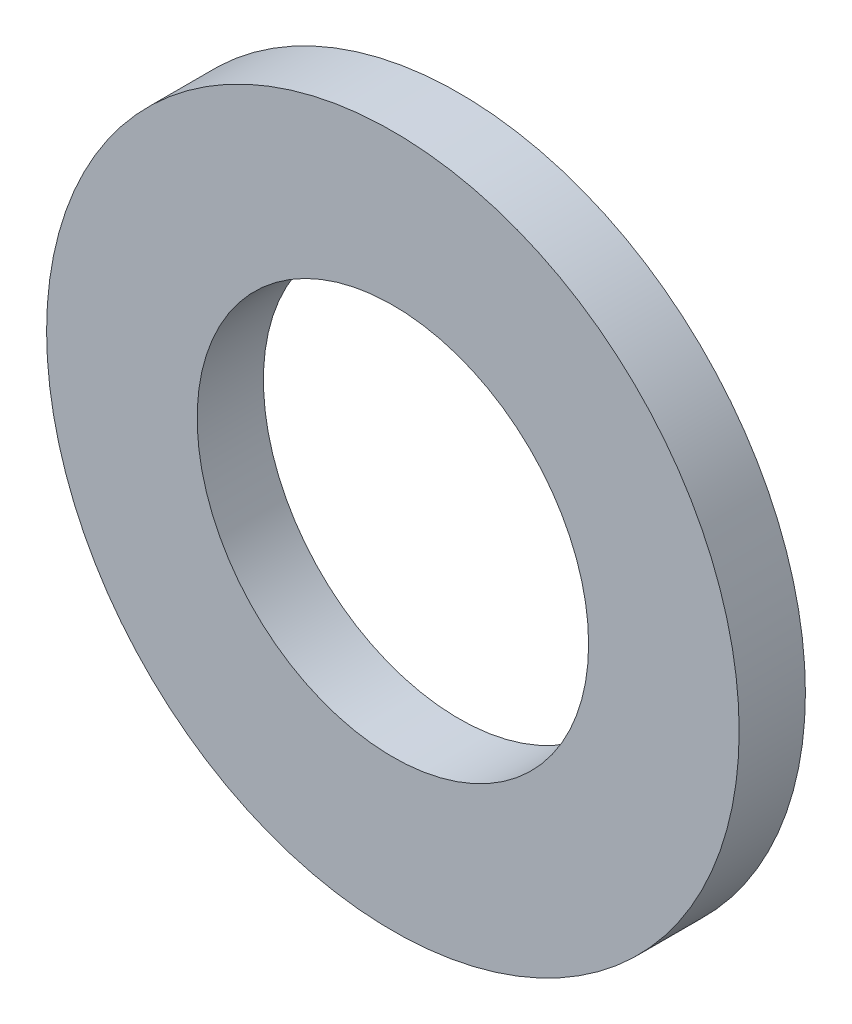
ISO-10303-21;
HEADER;
FILE_DESCRIPTION(('STEP AP214'),'2;1');
FILE_NAME('part.step','',(''),(''),'','','');
FILE_SCHEMA(('AUTOMOTIVE_DESIGN { 1 0 10303 214 1 1 1 1 }'));
ENDSEC;
DATA;
#1=APPLICATION_CONTEXT('core data for automotive mechanical design processes');
#2=APPLICATION_PROTOCOL_DEFINITION('international standard','automotive_design',2000,#1);
#3=PRODUCT_CONTEXT('',#1,'mechanical');
#4=PRODUCT('Part','Part','',(#3));
#5=PRODUCT_RELATED_PRODUCT_CATEGORY('part','',(#4));
#6=PRODUCT_DEFINITION_FORMATION('','',#4);
#7=PRODUCT_DEFINITION_CONTEXT('part definition',#1,'design');
#8=PRODUCT_DEFINITION('design','',#6,#7);
#9=PRODUCT_DEFINITION_SHAPE('','',#8);
#10=(LENGTH_UNIT() NAMED_UNIT(*) SI_UNIT(.MILLI.,.METRE.));
#11=(NAMED_UNIT(*) PLANE_ANGLE_UNIT() SI_UNIT($,.RADIAN.));
#12=(NAMED_UNIT(*) SI_UNIT($,.STERADIAN.) SOLID_ANGLE_UNIT());
#13=UNCERTAINTY_MEASURE_WITH_UNIT(LENGTH_MEASURE(1.E-05),#10,'distance_accuracy_value','');
#14=(GEOMETRIC_REPRESENTATION_CONTEXT(3) GLOBAL_UNCERTAINTY_ASSIGNED_CONTEXT((#13)) GLOBAL_UNIT_ASSIGNED_CONTEXT((#10,
#11,#12)) REPRESENTATION_CONTEXT('',''));
#15=CARTESIAN_POINT('',(0.,0.,0.));
#16=DIRECTION('',(0.,0.,1.));
#17=DIRECTION('',(1.,0.,0.));
#18=AXIS2_PLACEMENT_3D('',#15,#16,#17);
#19=CARTESIAN_POINT('',(0.,0.,2.19999999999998));
#20=DIRECTION('',(0.,0.,1.));
#21=DIRECTION('',(1.,0.,0.));
#22=AXIS2_PLACEMENT_3D('',#19,#20,#21);
#23=PLANE('',#22);
#24=CARTESIAN_POINT('',(0.,0.,2.19999999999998));
#25=DIRECTION('',(0.,0.,1.));
#26=DIRECTION('',(1.,0.,0.));
#27=AXIS2_PLACEMENT_3D('',#24,#25,#26);
#28=CIRCLE('',#27,11.5);
#29=CARTESIAN_POINT('',(11.5,0.,2.19999999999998));
#30=VERTEX_POINT('',#29);
#31=EDGE_CURVE('E10',#30,#30,#28,.T.);
#32=ORIENTED_EDGE('',*,*,#31,.T.);
#33=EDGE_LOOP('',(#32));
#34=FACE_BOUND('',#33,.T.);
#35=CARTESIAN_POINT('',(0.,0.,2.19999999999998));
#36=DIRECTION('',(0.,0.,1.));
#37=DIRECTION('',(1.,0.,0.));
#38=AXIS2_PLACEMENT_3D('',#35,#36,#37);
#39=CIRCLE('',#38,6.5);
#40=CARTESIAN_POINT('',(6.5,0.,2.19999999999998));
#41=VERTEX_POINT('',#40);
#42=EDGE_CURVE('E43',#41,#41,#39,.T.);
#43=ORIENTED_EDGE('',*,*,#42,.F.);
#44=EDGE_LOOP('',(#43));
#45=FACE_BOUND('',#44,.T.);
#46=ADVANCED_FACE('F32',(#34,#45),#23,.T.);
#47=CARTESIAN_POINT('',(0.,0.,0.));
#48=DIRECTION('',(0.,0.,1.));
#49=DIRECTION('',(1.,0.,0.));
#50=AXIS2_PLACEMENT_3D('',#47,#48,#49);
#51=PLANE('',#50);
#52=CARTESIAN_POINT('',(0.,0.,0.));
#53=DIRECTION('',(0.,0.,1.));
#54=DIRECTION('',(1.,0.,0.));
#55=AXIS2_PLACEMENT_3D('',#52,#53,#54);
#56=CIRCLE('',#55,11.5);
#57=CARTESIAN_POINT('',(11.5,0.,0.));
#58=VERTEX_POINT('',#57);
#59=EDGE_CURVE('E36',#58,#58,#56,.T.);
#60=ORIENTED_EDGE('',*,*,#59,.F.);
#61=EDGE_LOOP('',(#60));
#62=FACE_BOUND('',#61,.T.);
#63=CARTESIAN_POINT('',(0.,0.,0.));
#64=DIRECTION('',(0.,0.,1.));
#65=DIRECTION('',(1.,0.,0.));
#66=AXIS2_PLACEMENT_3D('',#63,#64,#65);
#67=CIRCLE('',#66,6.5);
#68=CARTESIAN_POINT('',(6.5,0.,0.));
#69=VERTEX_POINT('',#68);
#70=EDGE_CURVE('E45',#69,#69,#67,.T.);
#71=ORIENTED_EDGE('',*,*,#70,.T.);
#72=EDGE_LOOP('',(#71));
#73=FACE_BOUND('',#72,.T.);
#74=ADVANCED_FACE('F55',(#62,#73),#51,.F.);
#75=CARTESIAN_POINT('',(0.,0.,2.19999999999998));
#76=DIRECTION('',(0.,0.,-1.));
#77=DIRECTION('',(-1.,0.,0.));
#78=AXIS2_PLACEMENT_3D('',#75,#76,#77);
#79=CYLINDRICAL_SURFACE('',#78,11.5);
#80=ORIENTED_EDGE('',*,*,#31,.F.);
#81=EDGE_LOOP('',(#80));
#82=FACE_BOUND('',#81,.T.);
#83=ORIENTED_EDGE('',*,*,#59,.T.);
#84=EDGE_LOOP('',(#83));
#85=FACE_BOUND('',#84,.T.);
#86=ADVANCED_FACE('F34',(#82,#85),#79,.T.);
#87=CARTESIAN_POINT('',(0.,0.,2.19999999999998));
#88=DIRECTION('',(0.,0.,-1.));
#89=DIRECTION('',(-1.,0.,0.));
#90=AXIS2_PLACEMENT_3D('',#87,#88,#89);
#91=CYLINDRICAL_SURFACE('',#90,6.5);
#92=ORIENTED_EDGE('',*,*,#42,.T.);
#93=EDGE_LOOP('',(#92));
#94=FACE_BOUND('',#93,.T.);
#95=ORIENTED_EDGE('',*,*,#70,.F.);
#96=EDGE_LOOP('',(#95));
#97=FACE_BOUND('',#96,.T.);
#98=ADVANCED_FACE('F51',(#94,#97),#91,.F.);
#99=CLOSED_SHELL('',(#46,#74,#86,#98));
#100=MANIFOLD_SOLID_BREP('B2',#99);
#101=ADVANCED_BREP_SHAPE_REPRESENTATION('',(#18,#100),#14);
#102=SHAPE_DEFINITION_REPRESENTATION(#9,#101);
ENDSEC;
END-ISO-10303-21;
